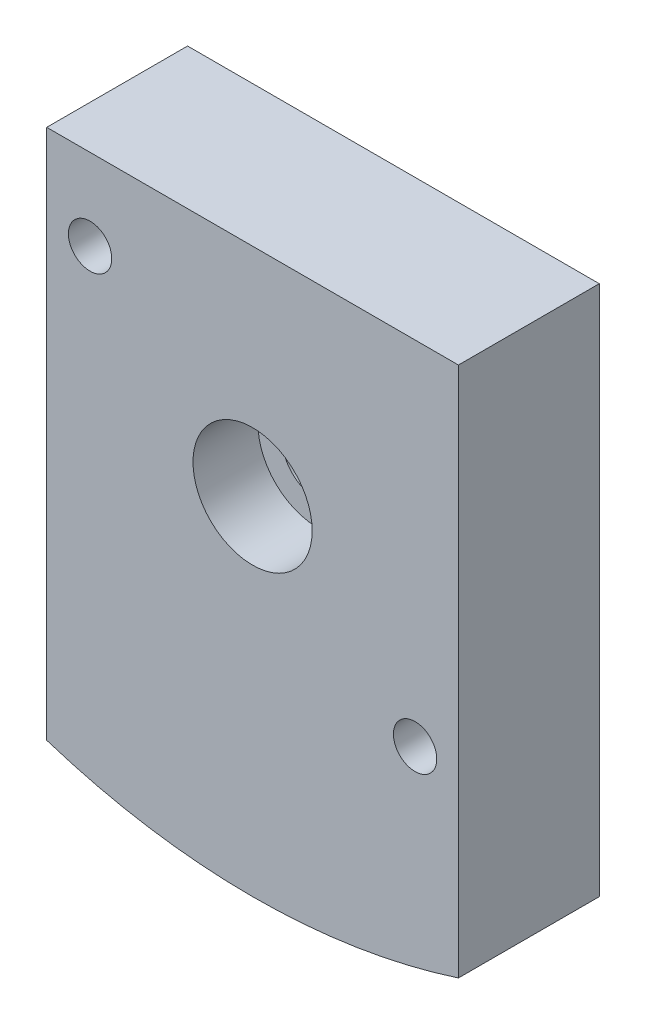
ISO-10303-21;
HEADER;
FILE_DESCRIPTION(('STEP AP214'),'2;1');
FILE_NAME('part.step','',(''),(''),'','','');
FILE_SCHEMA(('AUTOMOTIVE_DESIGN { 1 0 10303 214 1 1 1 1 }'));
ENDSEC;
DATA;
#1=APPLICATION_CONTEXT('core data for automotive mechanical design processes');
#2=APPLICATION_PROTOCOL_DEFINITION('international standard','automotive_design',2000,#1);
#3=PRODUCT_CONTEXT('',#1,'mechanical');
#4=PRODUCT('Part','Part','',(#3));
#5=PRODUCT_RELATED_PRODUCT_CATEGORY('part','',(#4));
#6=PRODUCT_DEFINITION_FORMATION('','',#4);
#7=PRODUCT_DEFINITION_CONTEXT('part definition',#1,'design');
#8=PRODUCT_DEFINITION('design','',#6,#7);
#9=PRODUCT_DEFINITION_SHAPE('','',#8);
#10=(LENGTH_UNIT() NAMED_UNIT(*) SI_UNIT(.MILLI.,.METRE.));
#11=(NAMED_UNIT(*) PLANE_ANGLE_UNIT() SI_UNIT($,.RADIAN.));
#12=(NAMED_UNIT(*) SI_UNIT($,.STERADIAN.) SOLID_ANGLE_UNIT());
#13=UNCERTAINTY_MEASURE_WITH_UNIT(LENGTH_MEASURE(1.E-05),#10,'distance_accuracy_value','');
#14=(GEOMETRIC_REPRESENTATION_CONTEXT(3) GLOBAL_UNCERTAINTY_ASSIGNED_CONTEXT((#13)) GLOBAL_UNIT_ASSIGNED_CONTEXT((#10,
#11,#12)) REPRESENTATION_CONTEXT('',''));
#15=CARTESIAN_POINT('',(0.,0.,0.));
#16=DIRECTION('',(0.,0.,1.));
#17=DIRECTION('',(1.,0.,0.));
#18=AXIS2_PLACEMENT_3D('',#15,#16,#17);
#19=CARTESIAN_POINT('',(-133.,52.,13.));
#20=DIRECTION('',(1.,0.,0.));
#21=DIRECTION('',(0.,0.,-1.));
#22=AXIS2_PLACEMENT_3D('',#19,#20,#21);
#23=PLANE('',#22);
#24=DIRECTION('',(0.,-1.,0.));
#25=VECTOR('',#24,1.);
#26=CARTESIAN_POINT('',(-133.,52.,0.));
#27=LINE('',#26,#25);
#28=CARTESIAN_POINT('',(-133.,52.,0.));
#29=VERTEX_POINT('',#28);
#30=CARTESIAN_POINT('',(-133.,3.,0.));
#31=VERTEX_POINT('',#30);
#32=EDGE_CURVE('E395',#29,#31,#27,.T.);
#33=ORIENTED_EDGE('',*,*,#32,.T.);
#34=DIRECTION('',(0.,0.,-1.));
#35=VECTOR('',#34,1.);
#36=CARTESIAN_POINT('',(-133.,3.,13.));
#37=LINE('',#36,#35);
#38=CARTESIAN_POINT('',(-133.,3.,13.));
#39=VERTEX_POINT('',#38);
#40=EDGE_CURVE('E11',#39,#31,#37,.T.);
#41=ORIENTED_EDGE('',*,*,#40,.F.);
#42=DIRECTION('',(0.,-1.,0.));
#43=VECTOR('',#42,1.);
#44=CARTESIAN_POINT('',(-133.,52.,13.));
#45=LINE('',#44,#43);
#46=CARTESIAN_POINT('',(-133.,52.,13.));
#47=VERTEX_POINT('',#46);
#48=EDGE_CURVE('E418',#47,#39,#45,.T.);
#49=ORIENTED_EDGE('',*,*,#48,.F.);
#50=DIRECTION('',(0.,0.,-1.));
#51=VECTOR('',#50,1.);
#52=CARTESIAN_POINT('',(-133.,52.,13.));
#53=LINE('',#52,#51);
#54=EDGE_CURVE('E407',#47,#29,#53,.T.);
#55=ORIENTED_EDGE('',*,*,#54,.T.);
#56=EDGE_LOOP('',(#33,#41,#49,#55));
#57=FACE_BOUND('',#56,.T.);
#58=ADVANCED_FACE('F351',(#57),#23,.F.);
#59=CARTESIAN_POINT('',(-114.,61.6666666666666,13.));
#60=DIRECTION('',(0.,0.,-1.));
#61=DIRECTION('',(-1.,0.,0.));
#62=AXIS2_PLACEMENT_3D('',#59,#60,#61);
#63=CYLINDRICAL_SURFACE('',#62,61.6666666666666);
#64=CARTESIAN_POINT('',(-114.,61.6666666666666,0.));
#65=DIRECTION('',(0.,0.,1.));
#66=DIRECTION('',(1.,0.,0.));
#67=AXIS2_PLACEMENT_3D('',#64,#65,#66);
#68=CIRCLE('',#67,61.6666666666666);
#69=CARTESIAN_POINT('',(-95.,3.,0.));
#70=VERTEX_POINT('',#69);
#71=EDGE_CURVE('E391',#31,#70,#68,.T.);
#72=ORIENTED_EDGE('',*,*,#71,.T.);
#73=DIRECTION('',(0.,0.,-1.));
#74=VECTOR('',#73,1.);
#75=CARTESIAN_POINT('',(-95.,3.,13.));
#76=LINE('',#75,#74);
#77=CARTESIAN_POINT('',(-95.,3.,13.));
#78=VERTEX_POINT('',#77);
#79=EDGE_CURVE('E358',#78,#70,#76,.T.);
#80=ORIENTED_EDGE('',*,*,#79,.F.);
#81=CARTESIAN_POINT('',(-114.,61.6666666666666,13.));
#82=DIRECTION('',(0.,0.,1.));
#83=DIRECTION('',(1.,0.,0.));
#84=AXIS2_PLACEMENT_3D('',#81,#82,#83);
#85=CIRCLE('',#84,61.6666666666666);
#86=EDGE_CURVE('E403',#39,#78,#85,.T.);
#87=ORIENTED_EDGE('',*,*,#86,.F.);
#88=ORIENTED_EDGE('',*,*,#40,.T.);
#89=EDGE_LOOP('',(#72,#80,#87,#88));
#90=FACE_BOUND('',#89,.T.);
#91=ADVANCED_FACE('F402',(#90),#63,.T.);
#92=CARTESIAN_POINT('',(-95.,52.,13.));
#93=DIRECTION('',(-1.,0.,0.));
#94=DIRECTION('',(0.,0.,1.));
#95=AXIS2_PLACEMENT_3D('',#92,#93,#94);
#96=PLANE('',#95);
#97=DIRECTION('',(0.,1.,0.));
#98=VECTOR('',#97,1.);
#99=CARTESIAN_POINT('',(-95.,52.,0.));
#100=LINE('',#99,#98);
#101=CARTESIAN_POINT('',(-95.,52.,0.));
#102=VERTEX_POINT('',#101);
#103=EDGE_CURVE('E396',#70,#102,#100,.T.);
#104=ORIENTED_EDGE('',*,*,#103,.T.);
#105=DIRECTION('',(0.,0.,-1.));
#106=VECTOR('',#105,1.);
#107=CARTESIAN_POINT('',(-95.,52.,13.));
#108=LINE('',#107,#106);
#109=CARTESIAN_POINT('',(-95.,52.,13.));
#110=VERTEX_POINT('',#109);
#111=EDGE_CURVE('E424',#110,#102,#108,.T.);
#112=ORIENTED_EDGE('',*,*,#111,.F.);
#113=DIRECTION('',(0.,1.,0.));
#114=VECTOR('',#113,1.);
#115=CARTESIAN_POINT('',(-95.,52.,13.));
#116=LINE('',#115,#114);
#117=EDGE_CURVE('E370',#78,#110,#116,.T.);
#118=ORIENTED_EDGE('',*,*,#117,.F.);
#119=ORIENTED_EDGE('',*,*,#79,.T.);
#120=EDGE_LOOP('',(#104,#112,#118,#119));
#121=FACE_BOUND('',#120,.T.);
#122=ADVANCED_FACE('F427',(#121),#96,.F.);
#123=CARTESIAN_POINT('',(-133.,52.,13.));
#124=DIRECTION('',(0.,-1.,0.));
#125=DIRECTION('',(1.,0.,0.));
#126=AXIS2_PLACEMENT_3D('',#123,#124,#125);
#127=PLANE('',#126);
#128=DIRECTION('',(-1.,0.,0.));
#129=VECTOR('',#128,1.);
#130=CARTESIAN_POINT('',(-133.,52.,0.));
#131=LINE('',#130,#129);
#132=EDGE_CURVE('E416',#102,#29,#131,.T.);
#133=ORIENTED_EDGE('',*,*,#132,.T.);
#134=ORIENTED_EDGE('',*,*,#54,.F.);
#135=DIRECTION('',(-1.,0.,0.));
#136=VECTOR('',#135,1.);
#137=CARTESIAN_POINT('',(-133.,52.,13.));
#138=LINE('',#137,#136);
#139=EDGE_CURVE('E365',#110,#47,#138,.T.);
#140=ORIENTED_EDGE('',*,*,#139,.F.);
#141=ORIENTED_EDGE('',*,*,#111,.T.);
#142=EDGE_LOOP('',(#133,#134,#140,#141));
#143=FACE_BOUND('',#142,.T.);
#144=ADVANCED_FACE('F429',(#143),#127,.F.);
#145=CARTESIAN_POINT('',(-114.,61.6666666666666,13.));
#146=DIRECTION('',(0.,0.,1.));
#147=DIRECTION('',(1.,0.,0.));
#148=AXIS2_PLACEMENT_3D('',#145,#146,#147);
#149=PLANE('',#148);
#150=CARTESIAN_POINT('',(-114.,32.,13.));
#151=DIRECTION('',(0.,0.,1.));
#152=DIRECTION('',(1.,0.,0.));
#153=AXIS2_PLACEMENT_3D('',#150,#151,#152);
#154=CIRCLE('',#153,5.49999999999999);
#155=CARTESIAN_POINT('',(-108.5,32.,13.));
#156=VERTEX_POINT('',#155);
#157=EDGE_CURVE('E515',#156,#156,#154,.T.);
#158=ORIENTED_EDGE('',*,*,#157,.F.);
#159=EDGE_LOOP('',(#158));
#160=FACE_BOUND('',#159,.T.);
#161=CARTESIAN_POINT('',(-129.,44.5,13.));
#162=DIRECTION('',(0.,0.,1.));
#163=DIRECTION('',(1.,0.,0.));
#164=AXIS2_PLACEMENT_3D('',#161,#162,#163);
#165=CIRCLE('',#164,2.);
#166=CARTESIAN_POINT('',(-127.,44.5,13.));
#167=VERTEX_POINT('',#166);
#168=EDGE_CURVE('E524',#167,#167,#165,.T.);
#169=ORIENTED_EDGE('',*,*,#168,.F.);
#170=EDGE_LOOP('',(#169));
#171=FACE_BOUND('',#170,.T.);
#172=CARTESIAN_POINT('',(-99.,19.5,13.));
#173=DIRECTION('',(0.,0.,1.));
#174=DIRECTION('',(1.,0.,0.));
#175=AXIS2_PLACEMENT_3D('',#172,#173,#174);
#176=CIRCLE('',#175,2.);
#177=CARTESIAN_POINT('',(-97.,19.5,13.));
#178=VERTEX_POINT('',#177);
#179=EDGE_CURVE('E408',#178,#178,#176,.T.);
#180=ORIENTED_EDGE('',*,*,#179,.F.);
#181=EDGE_LOOP('',(#180));
#182=FACE_BOUND('',#181,.T.);
#183=ORIENTED_EDGE('',*,*,#48,.T.);
#184=ORIENTED_EDGE('',*,*,#86,.T.);
#185=ORIENTED_EDGE('',*,*,#117,.T.);
#186=ORIENTED_EDGE('',*,*,#139,.T.);
#187=EDGE_LOOP('',(#183,#184,#185,#186));
#188=FACE_BOUND('',#187,.T.);
#189=ADVANCED_FACE('F430',(#160,#171,#182,#188),#149,.T.);
#190=CARTESIAN_POINT('',(-114.,61.6666666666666,0.));
#191=DIRECTION('',(0.,0.,1.));
#192=DIRECTION('',(1.,0.,0.));
#193=AXIS2_PLACEMENT_3D('',#190,#191,#192);
#194=PLANE('',#193);
#195=CARTESIAN_POINT('',(-114.,32.,0.));
#196=DIRECTION('',(0.,0.,1.));
#197=DIRECTION('',(1.,0.,0.));
#198=AXIS2_PLACEMENT_3D('',#195,#196,#197);
#199=CIRCLE('',#198,3.3);
#200=CARTESIAN_POINT('',(-110.7,32.,0.));
#201=VERTEX_POINT('',#200);
#202=EDGE_CURVE('E508',#201,#201,#199,.T.);
#203=ORIENTED_EDGE('',*,*,#202,.T.);
#204=EDGE_LOOP('',(#203));
#205=FACE_BOUND('',#204,.T.);
#206=CARTESIAN_POINT('',(-129.,44.5,0.));
#207=DIRECTION('',(0.,0.,1.));
#208=DIRECTION('',(1.,0.,0.));
#209=AXIS2_PLACEMENT_3D('',#206,#207,#208);
#210=CIRCLE('',#209,2.);
#211=CARTESIAN_POINT('',(-127.,44.5,0.));
#212=VERTEX_POINT('',#211);
#213=EDGE_CURVE('E521',#212,#212,#210,.T.);
#214=ORIENTED_EDGE('',*,*,#213,.T.);
#215=EDGE_LOOP('',(#214));
#216=FACE_BOUND('',#215,.T.);
#217=CARTESIAN_POINT('',(-99.,19.5,0.));
#218=DIRECTION('',(0.,0.,1.));
#219=DIRECTION('',(1.,0.,0.));
#220=AXIS2_PLACEMENT_3D('',#217,#218,#219);
#221=CIRCLE('',#220,2.);
#222=CARTESIAN_POINT('',(-97.,19.5,0.));
#223=VERTEX_POINT('',#222);
#224=EDGE_CURVE('E411',#223,#223,#221,.T.);
#225=ORIENTED_EDGE('',*,*,#224,.T.);
#226=EDGE_LOOP('',(#225));
#227=FACE_BOUND('',#226,.T.);
#228=ORIENTED_EDGE('',*,*,#32,.F.);
#229=ORIENTED_EDGE('',*,*,#132,.F.);
#230=ORIENTED_EDGE('',*,*,#103,.F.);
#231=ORIENTED_EDGE('',*,*,#71,.F.);
#232=EDGE_LOOP('',(#228,#229,#230,#231));
#233=FACE_BOUND('',#232,.T.);
#234=ADVANCED_FACE('F392',(#205,#216,#227,#233),#194,.F.);
#235=CARTESIAN_POINT('',(-99.,19.5,13.));
#236=DIRECTION('',(0.,0.,1.));
#237=DIRECTION('',(1.,0.,0.));
#238=AXIS2_PLACEMENT_3D('',#235,#236,#237);
#239=CYLINDRICAL_SURFACE('',#238,2.);
#240=ORIENTED_EDGE('',*,*,#224,.F.);
#241=EDGE_LOOP('',(#240));
#242=FACE_BOUND('',#241,.T.);
#243=ORIENTED_EDGE('',*,*,#179,.T.);
#244=EDGE_LOOP('',(#243));
#245=FACE_BOUND('',#244,.T.);
#246=ADVANCED_FACE('F438',(#242,#245),#239,.F.);
#247=CARTESIAN_POINT('',(-129.,44.5,13.));
#248=DIRECTION('',(0.,0.,1.));
#249=DIRECTION('',(1.,0.,0.));
#250=AXIS2_PLACEMENT_3D('',#247,#248,#249);
#251=CYLINDRICAL_SURFACE('',#250,2.);
#252=ORIENTED_EDGE('',*,*,#213,.F.);
#253=EDGE_LOOP('',(#252));
#254=FACE_BOUND('',#253,.T.);
#255=ORIENTED_EDGE('',*,*,#168,.T.);
#256=EDGE_LOOP('',(#255));
#257=FACE_BOUND('',#256,.T.);
#258=ADVANCED_FACE('F471',(#254,#257),#251,.F.);
#259=CARTESIAN_POINT('',(-114.,32.,13.));
#260=DIRECTION('',(0.,0.,1.));
#261=DIRECTION('',(1.,0.,0.));
#262=AXIS2_PLACEMENT_3D('',#259,#260,#261);
#263=CYLINDRICAL_SURFACE('',#262,5.49999999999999);
#264=CARTESIAN_POINT('',(-114.,32.,7.));
#265=DIRECTION('',(0.,0.,1.));
#266=DIRECTION('',(1.,0.,0.));
#267=AXIS2_PLACEMENT_3D('',#264,#265,#266);
#268=CIRCLE('',#267,5.49999999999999);
#269=CARTESIAN_POINT('',(-108.5,32.,7.));
#270=VERTEX_POINT('',#269);
#271=EDGE_CURVE('E512',#270,#270,#268,.T.);
#272=ORIENTED_EDGE('',*,*,#271,.F.);
#273=EDGE_LOOP('',(#272));
#274=FACE_BOUND('',#273,.T.);
#275=ORIENTED_EDGE('',*,*,#157,.T.);
#276=EDGE_LOOP('',(#275));
#277=FACE_BOUND('',#276,.T.);
#278=ADVANCED_FACE('F479',(#274,#277),#263,.F.);
#279=CARTESIAN_POINT('',(-110.7,32.,7.));
#280=DIRECTION('',(0.,0.,-1.));
#281=DIRECTION('',(-1.,0.,0.));
#282=AXIS2_PLACEMENT_3D('',#279,#280,#281);
#283=PLANE('',#282);
#284=CARTESIAN_POINT('',(-114.,32.,7.));
#285=DIRECTION('',(0.,0.,1.));
#286=DIRECTION('',(1.,0.,0.));
#287=AXIS2_PLACEMENT_3D('',#284,#285,#286);
#288=CIRCLE('',#287,3.3);
#289=CARTESIAN_POINT('',(-110.7,32.,7.));
#290=VERTEX_POINT('',#289);
#291=EDGE_CURVE('E511',#290,#290,#288,.T.);
#292=ORIENTED_EDGE('',*,*,#291,.F.);
#293=EDGE_LOOP('',(#292));
#294=FACE_BOUND('',#293,.T.);
#295=ORIENTED_EDGE('',*,*,#271,.T.);
#296=EDGE_LOOP('',(#295));
#297=FACE_BOUND('',#296,.T.);
#298=ADVANCED_FACE('F487',(#294,#297),#283,.F.);
#299=CARTESIAN_POINT('',(-114.,32.,13.));
#300=DIRECTION('',(0.,0.,1.));
#301=DIRECTION('',(1.,0.,0.));
#302=AXIS2_PLACEMENT_3D('',#299,#300,#301);
#303=CYLINDRICAL_SURFACE('',#302,3.3);
#304=ORIENTED_EDGE('',*,*,#202,.F.);
#305=EDGE_LOOP('',(#304));
#306=FACE_BOUND('',#305,.T.);
#307=ORIENTED_EDGE('',*,*,#291,.T.);
#308=EDGE_LOOP('',(#307));
#309=FACE_BOUND('',#308,.T.);
#310=ADVANCED_FACE('F495',(#306,#309),#303,.F.);
#311=CLOSED_SHELL('',(#58,#91,#122,#144,#189,#234,#246,#258,#278,#298,#310));
#312=MANIFOLD_SOLID_BREP('B2',#311);
#313=ADVANCED_BREP_SHAPE_REPRESENTATION('',(#18,#312),#14);
#314=SHAPE_DEFINITION_REPRESENTATION(#9,#313);
ENDSEC;
END-ISO-10303-21;
